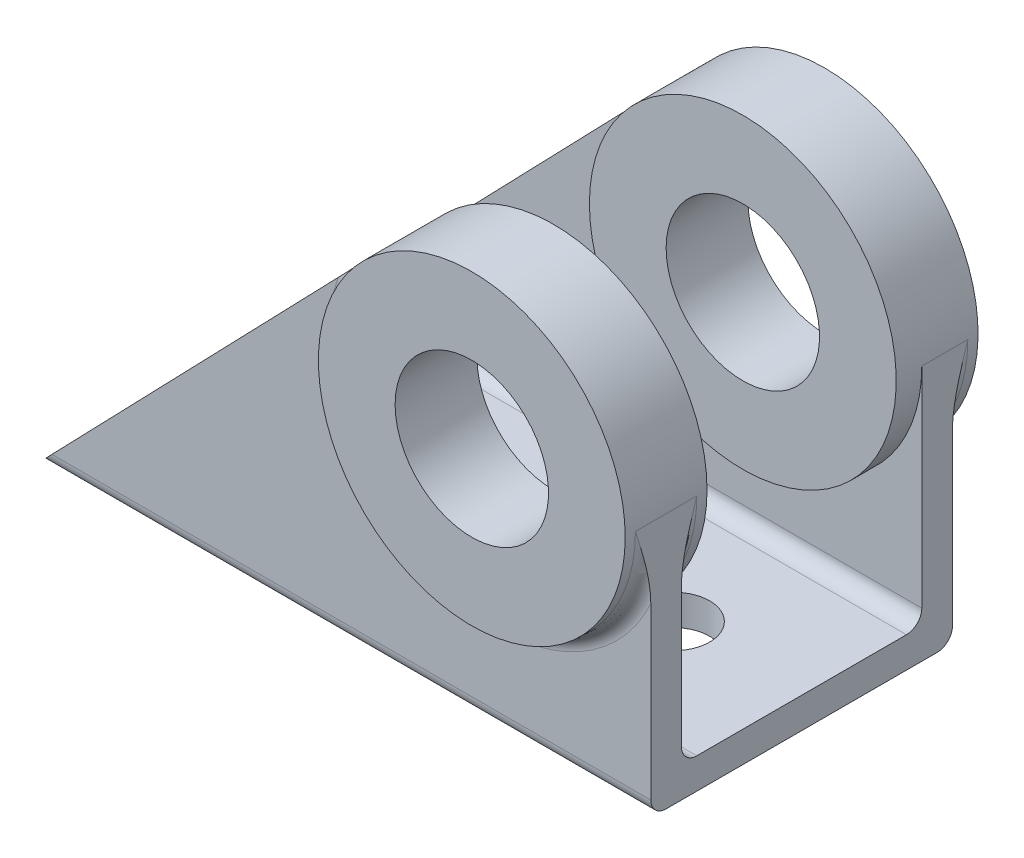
ISO-10303-21;
HEADER;
FILE_DESCRIPTION(('STEP AP214'),'2;1');
FILE_NAME('part.step','',(''),(''),'','','');
FILE_SCHEMA(('AUTOMOTIVE_DESIGN { 1 0 10303 214 1 1 1 1 }'));
ENDSEC;
DATA;
#1=APPLICATION_CONTEXT('core data for automotive mechanical design processes');
#2=APPLICATION_PROTOCOL_DEFINITION('international standard','automotive_design',2000,#1);
#3=PRODUCT_CONTEXT('',#1,'mechanical');
#4=PRODUCT('Part','Part','',(#3));
#5=PRODUCT_RELATED_PRODUCT_CATEGORY('part','',(#4));
#6=PRODUCT_DEFINITION_FORMATION('','',#4);
#7=PRODUCT_DEFINITION_CONTEXT('part definition',#1,'design');
#8=PRODUCT_DEFINITION('design','',#6,#7);
#9=PRODUCT_DEFINITION_SHAPE('','',#8);
#10=(LENGTH_UNIT() NAMED_UNIT(*) SI_UNIT(.MILLI.,.METRE.));
#11=(NAMED_UNIT(*) PLANE_ANGLE_UNIT() SI_UNIT($,.RADIAN.));
#12=(NAMED_UNIT(*) SI_UNIT($,.STERADIAN.) SOLID_ANGLE_UNIT());
#13=UNCERTAINTY_MEASURE_WITH_UNIT(LENGTH_MEASURE(1.E-05),#10,'distance_accuracy_value','');
#14=(GEOMETRIC_REPRESENTATION_CONTEXT(3) GLOBAL_UNCERTAINTY_ASSIGNED_CONTEXT((#13)) GLOBAL_UNIT_ASSIGNED_CONTEXT((#10,
#11,#12)) REPRESENTATION_CONTEXT('',''));
#15=CARTESIAN_POINT('',(0.,0.,0.));
#16=DIRECTION('',(0.,0.,1.));
#17=DIRECTION('',(1.,0.,0.));
#18=AXIS2_PLACEMENT_3D('',#15,#16,#17);
#19=CARTESIAN_POINT('',(5.79503497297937,5.99999999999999,-53.));
#20=DIRECTION('',(0.,1.,0.));
#21=DIRECTION('',(-1.,0.,0.));
#22=AXIS2_PLACEMENT_3D('',#19,#20,#21);
#23=PLANE('',#22);
#24=CARTESIAN_POINT('',(25.,5.99999999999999,-23.5));
#25=DIRECTION('',(0.,1.,0.));
#26=DIRECTION('',(-1.,0.,0.));
#27=AXIS2_PLACEMENT_3D('',#24,#25,#26);
#28=CIRCLE('',#27,7.);
#29=CARTESIAN_POINT('',(18.,5.99999999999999,-23.5));
#30=VERTEX_POINT('',#29);
#31=EDGE_CURVE('E435',#30,#30,#28,.T.);
#32=ORIENTED_EDGE('',*,*,#31,.F.);
#33=EDGE_LOOP('',(#32));
#34=FACE_BOUND('',#33,.T.);
#35=CARTESIAN_POINT('',(95.,5.99999999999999,-23.5));
#36=DIRECTION('',(0.,1.,0.));
#37=DIRECTION('',(-1.,0.,0.));
#38=AXIS2_PLACEMENT_3D('',#35,#36,#37);
#39=CIRCLE('',#38,7.);
#40=CARTESIAN_POINT('',(88.,5.99999999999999,-23.5));
#41=VERTEX_POINT('',#40);
#42=EDGE_CURVE('E427',#41,#41,#39,.T.);
#43=ORIENTED_EDGE('',*,*,#42,.F.);
#44=EDGE_LOOP('',(#43));
#45=FACE_BOUND('',#44,.T.);
#46=DIRECTION('',(0.,0.,1.));
#47=VECTOR('',#46,1.);
#48=CARTESIAN_POINT('',(5.79503497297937,5.99999999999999,-53.));
#49=LINE('',#48,#47);
#50=CARTESIAN_POINT('',(5.79503497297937,5.99999999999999,-44.));
#51=VERTEX_POINT('',#50);
#52=CARTESIAN_POINT('',(5.79503497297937,5.99999999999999,-3.));
#53=VERTEX_POINT('',#52);
#54=EDGE_CURVE('E244',#51,#53,#49,.T.);
#55=ORIENTED_EDGE('',*,*,#54,.T.);
#56=DIRECTION('',(-1.,0.,0.));
#57=VECTOR('',#56,1.);
#58=CARTESIAN_POINT('',(5.79503497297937,5.99999999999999,-3.));
#59=LINE('',#58,#57);
#60=CARTESIAN_POINT('',(120.,5.99999999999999,-3.));
#61=VERTEX_POINT('',#60);
#62=EDGE_CURVE('E325',#53,#61,#59,.F.);
#63=ORIENTED_EDGE('',*,*,#62,.T.);
#64=DIRECTION('',(0.,0.,1.));
#65=VECTOR('',#64,1.);
#66=CARTESIAN_POINT('',(120.,5.99999999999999,-53.));
#67=LINE('',#66,#65);
#68=CARTESIAN_POINT('',(120.,5.99999999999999,-44.));
#69=VERTEX_POINT('',#68);
#70=EDGE_CURVE('E243',#69,#61,#67,.T.);
#71=ORIENTED_EDGE('',*,*,#70,.F.);
#72=DIRECTION('',(-1.,0.,0.));
#73=VECTOR('',#72,1.);
#74=CARTESIAN_POINT('',(5.79503497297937,5.99999999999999,-44.));
#75=LINE('',#74,#73);
#76=EDGE_CURVE('E322',#69,#51,#75,.T.);
#77=ORIENTED_EDGE('',*,*,#76,.T.);
#78=EDGE_LOOP('',(#55,#63,#71,#77));
#79=FACE_BOUND('',#78,.T.);
#80=ADVANCED_FACE('F45',(#34,#45,#79),#23,.T.);
#81=CARTESIAN_POINT('',(68.4214276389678,70.841430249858,6.));
#82=DIRECTION('',(0.719285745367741,-0.694714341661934,0.));
#83=DIRECTION('',(0.694714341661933,0.719285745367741,0.));
#84=AXIS2_PLACEMENT_3D('',#81,#82,#83);
#85=PLANE('',#84);
#86=DIRECTION('',(0.,0.,-1.));
#87=VECTOR('',#86,1.);
#88=CARTESIAN_POINT('',(0.,0.,6.));
#89=LINE('',#88,#87);
#90=CARTESIAN_POINT('',(0.,0.,3.));
#91=VERTEX_POINT('',#90);
#92=CARTESIAN_POINT('',(0.,0.,-50.));
#93=VERTEX_POINT('',#92);
#94=EDGE_CURVE('E266',#91,#93,#89,.T.);
#95=ORIENTED_EDGE('',*,*,#94,.F.);
#96=CARTESIAN_POINT('',(2.8975174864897,3.,3.));
#97=DIRECTION('',(0.719285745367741,-0.694714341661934,0.));
#98=DIRECTION('',(-0.694714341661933,-0.719285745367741,0.));
#99=AXIS2_PLACEMENT_3D('',#96,#97,#98);
#100=ELLIPSE('',#99,4.17080418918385,3.);
#101=CARTESIAN_POINT('',(2.8975174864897,3.,6.));
#102=VERTEX_POINT('',#101);
#103=EDGE_CURVE('E320',#91,#102,#100,.F.);
#104=ORIENTED_EDGE('',*,*,#103,.T.);
#105=DIRECTION('',(-0.694714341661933,-0.719285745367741,0.));
#106=VECTOR('',#105,1.);
#107=CARTESIAN_POINT('',(68.4214276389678,70.841430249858,6.));
#108=LINE('',#107,#106);
#109=CARTESIAN_POINT('',(58.8706844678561,60.9528861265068,6.));
#110=VERTEX_POINT('',#109);
#111=EDGE_CURVE('E249',#110,#102,#108,.T.);
#112=ORIENTED_EDGE('',*,*,#111,.F.);
#113=CARTESIAN_POINT('',(58.8706844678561,60.9528861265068,6.));
#114=CARTESIAN_POINT('',(59.0469665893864,61.1354031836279,6.0000405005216));
#115=CARTESIAN_POINT('',(59.2232112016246,61.3178814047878,6.00558547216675));
#116=CARTESIAN_POINT('',(59.5753606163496,61.6824860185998,6.02646450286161));
#117=CARTESIAN_POINT('',(59.7512655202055,61.8646125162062,6.04179495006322));
#118=CARTESIAN_POINT('',(60.1023085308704,62.2280715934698,6.08099423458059));
#119=CARTESIAN_POINT('',(60.2774474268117,62.4094049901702,6.10484880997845));
#120=CARTESIAN_POINT('',(60.6271583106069,62.7714848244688,6.16012923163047));
#121=CARTESIAN_POINT('',(60.8017302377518,62.9522311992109,6.1915558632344));
#122=CARTESIAN_POINT('',(61.3223929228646,63.491309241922,6.29545901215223));
#123=CARTESIAN_POINT('',(61.6675388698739,63.8486626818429,6.37781613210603));
#124=CARTESIAN_POINT('',(62.3552134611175,64.5606596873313,6.56340767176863));
#125=CARTESIAN_POINT('',(62.6977407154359,64.9153018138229,6.66665247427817));
#126=CARTESIAN_POINT('',(63.491839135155,65.7374867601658,6.92593512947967));
#127=CARTESIAN_POINT('',(63.9424224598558,66.2040068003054,7.08819399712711));
#128=CARTESIAN_POINT('',(64.8398784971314,67.1332050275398,7.43285154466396));
#129=CARTESIAN_POINT('',(65.2867504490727,67.5958824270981,7.61525424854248));
#130=CARTESIAN_POINT('',(66.6246104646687,68.9810613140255,8.18214148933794));
#131=CARTESIAN_POINT('',(67.5116040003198,69.8994269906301,8.58585670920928));
#132=CARTESIAN_POINT('',(68.4061305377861,70.8255921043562,8.99303691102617));
#133=CARTESIAN_POINT('',(68.4137790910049,70.833511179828,8.99651846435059));
#134=CARTESIAN_POINT('',(68.4214276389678,70.841430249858,9.));
#135=B_SPLINE_CURVE_WITH_KNOTS('',3,(#113,#114,#115,#116,#117,#118,#119,#120,#121,#122,#123,
#124,#125,#126,#127,#128,#129,#130,#131,#132,#133,#134),.UNSPECIFIED.,.F.,.F.,(4,2,2,2,2,2,2,2,
2,2,4),(0.,0.761105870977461,1.52193097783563,2.28148904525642,3.04112592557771,
4.55127561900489,6.06217782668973,8.06739597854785,10.0730154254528,14.0897645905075,
14.1244056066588),.UNSPECIFIED.);
#136=CARTESIAN_POINT('',(68.4214276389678,70.841430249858,9.));
#137=VERTEX_POINT('',#136);
#138=EDGE_CURVE('E403',#110,#137,#135,.T.);
#139=ORIENTED_EDGE('',*,*,#138,.T.);
#140=DIRECTION('',(0.,0.,-1.));
#141=VECTOR('',#140,1.);
#142=CARTESIAN_POINT('',(68.4214276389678,70.841430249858,6.));
#143=LINE('',#142,#141);
#144=CARTESIAN_POINT('',(68.4214276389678,70.841430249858,-3.));
#145=VERTEX_POINT('',#144);
#146=EDGE_CURVE('E256',#137,#145,#143,.T.);
#147=ORIENTED_EDGE('',*,*,#146,.T.);
#148=CARTESIAN_POINT('',(58.8706844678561,60.9528861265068,0.));
#149=CARTESIAN_POINT('',(59.0469665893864,61.1354031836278,-4.05005216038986E-05));
#150=CARTESIAN_POINT('',(59.2232112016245,61.3178814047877,-0.00558547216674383));
#151=CARTESIAN_POINT('',(59.5753606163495,61.6824860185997,-0.026464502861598));
#152=CARTESIAN_POINT('',(59.7512655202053,61.864612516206,-0.0417949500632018));
#153=CARTESIAN_POINT('',(60.1023085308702,62.2280715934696,-0.0809942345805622));
#154=CARTESIAN_POINT('',(60.2774474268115,62.40940499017,-0.104848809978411));
#155=CARTESIAN_POINT('',(60.6271583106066,62.7714848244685,-0.160129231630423));
#156=CARTESIAN_POINT('',(60.8017302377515,62.9522311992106,-0.191555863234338));
#157=CARTESIAN_POINT('',(61.3223929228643,63.4913092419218,-0.295459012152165));
#158=CARTESIAN_POINT('',(61.6675388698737,63.8486626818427,-0.377816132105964));
#159=CARTESIAN_POINT('',(62.3552134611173,64.5606596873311,-0.563407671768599));
#160=CARTESIAN_POINT('',(62.6977407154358,64.9153018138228,-0.666652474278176));
#161=CARTESIAN_POINT('',(63.491839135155,65.7374867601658,-0.925935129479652));
#162=CARTESIAN_POINT('',(63.9424224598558,66.2040068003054,-1.088193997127));
#163=CARTESIAN_POINT('',(64.8398784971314,67.1332050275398,-1.43285154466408));
#164=CARTESIAN_POINT('',(65.2867504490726,67.5958824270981,-1.6152542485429));
#165=CARTESIAN_POINT('',(66.624610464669,68.9810613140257,-2.18214148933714));
#166=CARTESIAN_POINT('',(67.5116040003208,69.8994269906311,-2.58585670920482));
#167=CARTESIAN_POINT('',(68.4061305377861,70.8255921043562,-2.99303691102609));
#168=CARTESIAN_POINT('',(68.4137790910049,70.833511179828,-2.99651846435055));
#169=CARTESIAN_POINT('',(68.4214276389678,70.841430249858,-3.));
#170=B_SPLINE_CURVE_WITH_KNOTS('',3,(#148,#149,#150,#151,#152,#153,#154,#155,#156,#157,#158,
#159,#160,#161,#162,#163,#164,#165,#166,#167,#168,#169),.UNSPECIFIED.,.F.,.F.,(4,2,2,2,2,2,2,2,
2,2,4),(0.,0.761105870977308,1.52193097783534,2.28148904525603,3.0411259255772,4.55127561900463,
6.06217782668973,8.06739597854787,10.0730154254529,14.0897645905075,14.1244056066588),.UNSPECIFIED.);
#171=CARTESIAN_POINT('',(58.8706844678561,60.9528861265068,0.));
#172=VERTEX_POINT('',#171);
#173=EDGE_CURVE('E391',#145,#172,#170,.F.);
#174=ORIENTED_EDGE('',*,*,#173,.T.);
#175=DIRECTION('',(-0.694714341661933,-0.719285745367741,0.));
#176=VECTOR('',#175,1.);
#177=CARTESIAN_POINT('',(68.4214276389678,70.841430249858,0.));
#178=LINE('',#177,#176);
#179=CARTESIAN_POINT('',(8.69255245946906,8.99999999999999,0.));
#180=VERTEX_POINT('',#179);
#181=EDGE_CURVE('E246',#172,#180,#178,.T.);
#182=ORIENTED_EDGE('',*,*,#181,.T.);
#183=CARTESIAN_POINT('',(8.69255245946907,8.99999999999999,-3.));
#184=DIRECTION('',(0.719285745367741,-0.694714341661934,0.));
#185=DIRECTION('',(-0.694714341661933,-0.719285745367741,0.));
#186=AXIS2_PLACEMENT_3D('',#183,#184,#185);
#187=ELLIPSE('',#186,4.17080418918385,3.);
#188=EDGE_CURVE('E67',#180,#53,#187,.T.);
#189=ORIENTED_EDGE('',*,*,#188,.T.);
#190=ORIENTED_EDGE('',*,*,#54,.F.);
#191=CARTESIAN_POINT('',(8.69255245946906,8.99999999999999,-44.));
#192=DIRECTION('',(0.719285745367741,-0.694714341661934,0.));
#193=DIRECTION('',(-0.694714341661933,-0.719285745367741,0.));
#194=AXIS2_PLACEMENT_3D('',#191,#192,#193);
#195=ELLIPSE('',#194,4.17080418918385,3.);
#196=CARTESIAN_POINT('',(8.69255245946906,8.99999999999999,-47.));
#197=VERTEX_POINT('',#196);
#198=EDGE_CURVE('E54',#51,#197,#195,.T.);
#199=ORIENTED_EDGE('',*,*,#198,.T.);
#200=DIRECTION('',(0.694714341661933,0.719285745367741,0.));
#201=VECTOR('',#200,1.);
#202=CARTESIAN_POINT('',(5.79503497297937,5.99999999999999,-47.));
#203=LINE('',#202,#201);
#204=CARTESIAN_POINT('',(68.4214276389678,70.841430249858,-47.));
#205=VERTEX_POINT('',#204);
#206=EDGE_CURVE('E231',#197,#205,#203,.T.);
#207=ORIENTED_EDGE('',*,*,#206,.T.);
#208=DIRECTION('',(0.,0.,-1.));
#209=VECTOR('',#208,1.);
#210=CARTESIAN_POINT('',(68.4214276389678,70.841430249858,-47.));
#211=LINE('',#210,#209);
#212=CARTESIAN_POINT('',(68.4214276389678,70.841430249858,-56.));
#213=VERTEX_POINT('',#212);
#214=EDGE_CURVE('E234',#205,#213,#211,.T.);
#215=ORIENTED_EDGE('',*,*,#214,.T.);
#216=CARTESIAN_POINT('',(58.8706844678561,60.9528861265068,-53.));
#217=CARTESIAN_POINT('',(59.0469665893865,61.135403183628,-53.0000405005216));
#218=CARTESIAN_POINT('',(59.2232112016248,61.317881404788,-53.0055854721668));
#219=CARTESIAN_POINT('',(59.57536061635,61.6824860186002,-53.0264645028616));
#220=CARTESIAN_POINT('',(59.751265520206,61.8646125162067,-53.0417949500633));
#221=CARTESIAN_POINT('',(60.102308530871,62.2280715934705,-53.0809942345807));
#222=CARTESIAN_POINT('',(60.2774474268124,62.4094049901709,-53.1048488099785));
#223=CARTESIAN_POINT('',(60.6271583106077,62.7714848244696,-53.1601292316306));
#224=CARTESIAN_POINT('',(60.8017302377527,62.9522311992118,-53.1915558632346));
#225=CARTESIAN_POINT('',(61.3223929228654,63.4913092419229,-53.2954590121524));
#226=CARTESIAN_POINT('',(61.6675388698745,63.8486626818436,-53.3778161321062));
#227=CARTESIAN_POINT('',(62.3552134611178,64.5606596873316,-53.5634076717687));
#228=CARTESIAN_POINT('',(62.6977407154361,64.915301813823,-53.6666524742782));
#229=CARTESIAN_POINT('',(63.491839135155,65.7374867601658,-53.9259351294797));
#230=CARTESIAN_POINT('',(63.9424224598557,66.2040068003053,-54.0881939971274));
#231=CARTESIAN_POINT('',(64.8398784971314,67.1332050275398,-54.4328515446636));
#232=CARTESIAN_POINT('',(65.2867504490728,67.5958824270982,-54.6152542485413));
#233=CARTESIAN_POINT('',(66.6246104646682,68.9810613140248,-55.1821414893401));
#234=CARTESIAN_POINT('',(67.5116040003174,69.8994269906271,-55.5858567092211));
#235=CARTESIAN_POINT('',(68.4061305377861,70.8255921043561,-55.9930369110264));
#236=CARTESIAN_POINT('',(68.4137790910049,70.833511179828,-55.9965184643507));
#237=CARTESIAN_POINT('',(68.4214276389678,70.841430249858,-56.));
#238=B_SPLINE_CURVE_WITH_KNOTS('',3,(#216,#217,#218,#219,#220,#221,#222,#223,#224,#225,#226,
#227,#228,#229,#230,#231,#232,#233,#234,#235,#236,#237),.UNSPECIFIED.,.F.,.F.,(4,2,2,2,2,2,2,2,
2,2,4),(0.,0.761105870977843,1.52193097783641,2.2814890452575,3.0411259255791,4.55127561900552,
6.06217782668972,8.06739597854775,10.0730154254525,14.0897645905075,14.1244056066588),.UNSPECIFIED.);
#239=CARTESIAN_POINT('',(58.8706844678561,60.9528861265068,-53.));
#240=VERTEX_POINT('',#239);
#241=EDGE_CURVE('E340',#213,#240,#238,.F.);
#242=ORIENTED_EDGE('',*,*,#241,.T.);
#243=DIRECTION('',(-0.694714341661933,-0.719285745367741,0.));
#244=VECTOR('',#243,1.);
#245=CARTESIAN_POINT('',(0.,0.,-53.));
#246=LINE('',#245,#244);
#247=CARTESIAN_POINT('',(2.89751748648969,3.,-53.));
#248=VERTEX_POINT('',#247);
#249=EDGE_CURVE('E236',#240,#248,#246,.T.);
#250=ORIENTED_EDGE('',*,*,#249,.T.);
#251=CARTESIAN_POINT('',(2.89751748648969,3.,-50.));
#252=DIRECTION('',(0.719285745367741,-0.694714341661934,0.));
#253=DIRECTION('',(-0.694714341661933,-0.719285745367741,0.));
#254=AXIS2_PLACEMENT_3D('',#251,#252,#253);
#255=ELLIPSE('',#254,4.17080418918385,3.);
#256=EDGE_CURVE('E318',#248,#93,#255,.F.);
#257=ORIENTED_EDGE('',*,*,#256,.T.);
#258=EDGE_LOOP('',(#95,#104,#112,#139,#147,#174,#182,#189,#190,#199,#207,#215,#242,#250,#257));
#259=FACE_BOUND('',#258,.T.);
#260=ADVANCED_FACE('F359',(#259),#85,.F.);
#261=CARTESIAN_POINT('',(0.,0.,6.));
#262=DIRECTION('',(0.,1.,0.));
#263=DIRECTION('',(0.,0.,1.));
#264=AXIS2_PLACEMENT_3D('',#261,#262,#263);
#265=PLANE('',#264);
#266=CARTESIAN_POINT('',(25.,0.,-23.5));
#267=DIRECTION('',(0.,1.,0.));
#268=DIRECTION('',(0.,0.,1.));
#269=AXIS2_PLACEMENT_3D('',#266,#267,#268);
#270=CIRCLE('',#269,7.);
#271=CARTESIAN_POINT('',(25.,0.,-16.5));
#272=VERTEX_POINT('',#271);
#273=EDGE_CURVE('E49',#272,#272,#270,.T.);
#274=ORIENTED_EDGE('',*,*,#273,.T.);
#275=EDGE_LOOP('',(#274));
#276=FACE_BOUND('',#275,.T.);
#277=CARTESIAN_POINT('',(95.,0.,-23.5));
#278=DIRECTION('',(0.,1.,0.));
#279=DIRECTION('',(0.,0.,1.));
#280=AXIS2_PLACEMENT_3D('',#277,#278,#279);
#281=CIRCLE('',#280,7.);
#282=CARTESIAN_POINT('',(95.,0.,-16.5));
#283=VERTEX_POINT('',#282);
#284=EDGE_CURVE('E417',#283,#283,#281,.T.);
#285=ORIENTED_EDGE('',*,*,#284,.T.);
#286=EDGE_LOOP('',(#285));
#287=FACE_BOUND('',#286,.T.);
#288=DIRECTION('',(0.,0.,-1.));
#289=VECTOR('',#288,1.);
#290=CARTESIAN_POINT('',(120.,0.,6.));
#291=LINE('',#290,#289);
#292=CARTESIAN_POINT('',(120.,0.,3.));
#293=VERTEX_POINT('',#292);
#294=CARTESIAN_POINT('',(120.,0.,-50.));
#295=VERTEX_POINT('',#294);
#296=EDGE_CURVE('E263',#293,#295,#291,.T.);
#297=ORIENTED_EDGE('',*,*,#296,.F.);
#298=DIRECTION('',(1.,0.,0.));
#299=VECTOR('',#298,1.);
#300=CARTESIAN_POINT('',(0.,0.,3.));
#301=LINE('',#300,#299);
#302=EDGE_CURVE('E316',#293,#91,#301,.F.);
#303=ORIENTED_EDGE('',*,*,#302,.T.);
#304=ORIENTED_EDGE('',*,*,#94,.T.);
#305=DIRECTION('',(1.,0.,0.));
#306=VECTOR('',#305,1.);
#307=CARTESIAN_POINT('',(120.,0.,-50.));
#308=LINE('',#307,#306);
#309=EDGE_CURVE('E313',#93,#295,#308,.T.);
#310=ORIENTED_EDGE('',*,*,#309,.T.);
#311=EDGE_LOOP('',(#297,#303,#304,#310));
#312=FACE_BOUND('',#311,.T.);
#313=ADVANCED_FACE('F481',(#276,#287,#312),#265,.F.);
#314=CARTESIAN_POINT('',(120.,0.,6.));
#315=DIRECTION('',(-1.,0.,0.));
#316=DIRECTION('',(0.,0.,1.));
#317=AXIS2_PLACEMENT_3D('',#314,#315,#316);
#318=PLANE('',#317);
#319=DIRECTION('',(0.,1.,0.));
#320=VECTOR('',#319,1.);
#321=CARTESIAN_POINT('',(120.,0.,6.));
#322=LINE('',#321,#320);
#323=CARTESIAN_POINT('',(120.,3.,6.));
#324=VERTEX_POINT('',#323);
#325=CARTESIAN_POINT('',(120.,36.2522729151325,6.));
#326=VERTEX_POINT('',#325);
#327=EDGE_CURVE('E252',#324,#326,#322,.T.);
#328=ORIENTED_EDGE('',*,*,#327,.F.);
#329=CARTESIAN_POINT('',(120.,3.,3.));
#330=DIRECTION('',(-1.,0.,0.));
#331=DIRECTION('',(0.,0.,1.));
#332=AXIS2_PLACEMENT_3D('',#329,#330,#331);
#333=CIRCLE('',#332,3.);
#334=EDGE_CURVE('E311',#324,#293,#333,.F.);
#335=ORIENTED_EDGE('',*,*,#334,.T.);
#336=ORIENTED_EDGE('',*,*,#296,.T.);
#337=CARTESIAN_POINT('',(120.,3.,-50.));
#338=DIRECTION('',(-1.,0.,0.));
#339=DIRECTION('',(0.,0.,1.));
#340=AXIS2_PLACEMENT_3D('',#337,#338,#339);
#341=CIRCLE('',#340,3.);
#342=CARTESIAN_POINT('',(120.,3.,-53.));
#343=VERTEX_POINT('',#342);
#344=EDGE_CURVE('E309',#295,#343,#341,.F.);
#345=ORIENTED_EDGE('',*,*,#344,.T.);
#346=DIRECTION('',(0.,1.,0.));
#347=VECTOR('',#346,1.);
#348=CARTESIAN_POINT('',(120.,5.99999999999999,-53.));
#349=LINE('',#348,#347);
#350=CARTESIAN_POINT('',(120.,36.2522729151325,-53.));
#351=VERTEX_POINT('',#350);
#352=EDGE_CURVE('E240',#343,#351,#349,.T.);
#353=ORIENTED_EDGE('',*,*,#352,.T.);
#354=CARTESIAN_POINT('',(120.,36.2522729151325,-53.));
#355=CARTESIAN_POINT('',(120.,36.506020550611,-53.0000405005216));
#356=CARTESIAN_POINT('',(120.,36.7597141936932,-53.0055854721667));
#357=CARTESIAN_POINT('',(120.,37.2666123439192,-53.0264645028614));
#358=CARTESIAN_POINT('',(120.,37.5198169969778,-53.041794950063));
#359=CARTESIAN_POINT('',(120.,38.0251225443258,-53.0809942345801));
#360=CARTESIAN_POINT('',(120.,38.2772245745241,-53.1048488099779));
#361=CARTESIAN_POINT('',(120.,38.7806126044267,-53.1601292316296));
#362=CARTESIAN_POINT('',(120.,39.0318985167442,-53.1915558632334));
#363=CARTESIAN_POINT('',(120.,39.781361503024,-53.2954590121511));
#364=CARTESIAN_POINT('',(120.,40.2781785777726,-53.377816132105));
#365=CARTESIAN_POINT('',(120.,41.268045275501,-53.5634076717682));
#366=CARTESIAN_POINT('',(120.,41.7610928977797,-53.6666524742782));
#367=CARTESIAN_POINT('',(120.,42.9041503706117,-53.9259351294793));
#368=CARTESIAN_POINT('',(120.,43.5527382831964,-54.0881939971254));
#369=CARTESIAN_POINT('',(120.,44.8445729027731,-54.432851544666));
#370=CARTESIAN_POINT('',(120.,45.4878185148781,-54.6152542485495));
#371=CARTESIAN_POINT('',(120.,47.4135884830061,-55.1821414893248));
#372=CARTESIAN_POINT('',(120.,48.6903629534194,-55.5858567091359));
#373=CARTESIAN_POINT('',(120.,49.9779807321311,-55.9930369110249));
#374=CARTESIAN_POINT('',(120.,49.9889903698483,-55.9965184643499));
#375=CARTESIAN_POINT('',(120.,50.,-56.));
#376=B_SPLINE_CURVE_WITH_KNOTS('',3,(#354,#355,#356,#357,#358,#359,#360,#361,#362,#363,#364,
#365,#366,#367,#368,#369,#370,#371,#372,#373,#374,#375),.UNSPECIFIED.,.F.,.F.,(4,2,2,2,2,2,2,2,
2,2,4),(0.,0.761105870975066,1.52193097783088,2.28148904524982,3.04112592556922,4.5512756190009,
6.06217782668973,8.06739597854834,10.0730154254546,14.0897645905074,14.1244056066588),.UNSPECIFIED.);
#377=CARTESIAN_POINT('',(120.,50.,-56.));
#378=VERTEX_POINT('',#377);
#379=EDGE_CURVE('E331',#351,#378,#376,.T.);
#380=ORIENTED_EDGE('',*,*,#379,.T.);
#381=DIRECTION('',(0.,0.,-1.));
#382=VECTOR('',#381,1.);
#383=CARTESIAN_POINT('',(120.,50.,-47.));
#384=LINE('',#383,#382);
#385=CARTESIAN_POINT('',(120.,50.,-47.));
#386=VERTEX_POINT('',#385);
#387=EDGE_CURVE('E233',#386,#378,#384,.T.);
#388=ORIENTED_EDGE('',*,*,#387,.F.);
#389=DIRECTION('',(0.,-1.,0.));
#390=VECTOR('',#389,1.);
#391=CARTESIAN_POINT('',(120.,50.,-47.));
#392=LINE('',#391,#390);
#393=CARTESIAN_POINT('',(120.,8.99999999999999,-47.));
#394=VERTEX_POINT('',#393);
#395=EDGE_CURVE('E228',#386,#394,#392,.T.);
#396=ORIENTED_EDGE('',*,*,#395,.T.);
#397=CARTESIAN_POINT('',(120.,8.99999999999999,-44.));
#398=DIRECTION('',(-1.,0.,0.));
#399=DIRECTION('',(0.,0.,1.));
#400=AXIS2_PLACEMENT_3D('',#397,#398,#399);
#401=CIRCLE('',#400,3.);
#402=EDGE_CURVE('E11',#394,#69,#401,.T.);
#403=ORIENTED_EDGE('',*,*,#402,.T.);
#404=ORIENTED_EDGE('',*,*,#70,.T.);
#405=CARTESIAN_POINT('',(120.,8.99999999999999,-3.));
#406=DIRECTION('',(-1.,0.,0.));
#407=DIRECTION('',(0.,0.,1.));
#408=AXIS2_PLACEMENT_3D('',#405,#406,#407);
#409=CIRCLE('',#408,3.);
#410=CARTESIAN_POINT('',(120.,8.99999999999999,0.));
#411=VERTEX_POINT('',#410);
#412=EDGE_CURVE('E411',#61,#411,#409,.T.);
#413=ORIENTED_EDGE('',*,*,#412,.T.);
#414=DIRECTION('',(0.,1.,0.));
#415=VECTOR('',#414,1.);
#416=CARTESIAN_POINT('',(120.,0.,0.));
#417=LINE('',#416,#415);
#418=CARTESIAN_POINT('',(120.,36.2522729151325,0.));
#419=VERTEX_POINT('',#418);
#420=EDGE_CURVE('E253',#411,#419,#417,.T.);
#421=ORIENTED_EDGE('',*,*,#420,.T.);
#422=CARTESIAN_POINT('',(120.,36.2522729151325,0.));
#423=CARTESIAN_POINT('',(120.,36.506020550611,-4.05005216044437E-05));
#424=CARTESIAN_POINT('',(120.,36.7597141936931,-0.00558547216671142));
#425=CARTESIAN_POINT('',(120.,37.2666123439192,-0.0264645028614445));
#426=CARTESIAN_POINT('',(120.,37.5198169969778,-0.0417949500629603));
#427=CARTESIAN_POINT('',(120.,38.0251225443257,-0.0809942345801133));
#428=CARTESIAN_POINT('',(120.,38.277224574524,-0.104848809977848));
#429=CARTESIAN_POINT('',(120.,38.7806126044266,-0.160129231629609));
#430=CARTESIAN_POINT('',(120.,39.0318985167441,-0.191555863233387));
#431=CARTESIAN_POINT('',(120.,39.7813615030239,-0.295459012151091));
#432=CARTESIAN_POINT('',(120.,40.2781785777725,-0.377816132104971));
#433=CARTESIAN_POINT('',(120.,41.268045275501,-0.563407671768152));
#434=CARTESIAN_POINT('',(120.,41.7610928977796,-0.666652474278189));
#435=CARTESIAN_POINT('',(120.,42.9041503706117,-0.925935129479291));
#436=CARTESIAN_POINT('',(120.,43.5527382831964,-1.08819399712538));
#437=CARTESIAN_POINT('',(120.,44.8445729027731,-1.43285154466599));
#438=CARTESIAN_POINT('',(120.,45.4878185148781,-1.61525424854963));
#439=CARTESIAN_POINT('',(120.,47.4135884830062,-2.1821414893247));
#440=CARTESIAN_POINT('',(120.,48.6903629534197,-2.58585670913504));
#441=CARTESIAN_POINT('',(120.,49.9779807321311,-2.99303691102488));
#442=CARTESIAN_POINT('',(120.,49.9889903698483,-2.99651846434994));
#443=CARTESIAN_POINT('',(120.,50.,-3.));
#444=B_SPLINE_CURVE_WITH_KNOTS('',3,(#422,#423,#424,#425,#426,#427,#428,#429,#430,#431,#432,
#433,#434,#435,#436,#437,#438,#439,#440,#441,#442,#443),.UNSPECIFIED.,.F.,.F.,(4,2,2,2,2,2,2,2,
2,2,4),(0.,0.761105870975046,1.52193097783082,2.28148904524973,3.04112592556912,
4.55127561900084,6.06217782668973,8.06739597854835,10.0730154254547,14.0897645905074,
14.1244056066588),.UNSPECIFIED.);
#445=CARTESIAN_POINT('',(120.,50.,-3.));
#446=VERTEX_POINT('',#445);
#447=EDGE_CURVE('E385',#419,#446,#444,.T.);
#448=ORIENTED_EDGE('',*,*,#447,.T.);
#449=DIRECTION('',(0.,0.,-1.));
#450=VECTOR('',#449,1.);
#451=CARTESIAN_POINT('',(120.,50.,6.));
#452=LINE('',#451,#450);
#453=CARTESIAN_POINT('',(120.,50.,9.));
#454=VERTEX_POINT('',#453);
#455=EDGE_CURVE('E261',#454,#446,#452,.T.);
#456=ORIENTED_EDGE('',*,*,#455,.F.);
#457=CARTESIAN_POINT('',(120.,36.2522729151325,6.));
#458=CARTESIAN_POINT('',(120.,36.506020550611,6.0000405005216));
#459=CARTESIAN_POINT('',(120.,36.7597141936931,6.00558547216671));
#460=CARTESIAN_POINT('',(120.,37.2666123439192,6.02646450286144));
#461=CARTESIAN_POINT('',(120.,37.5198169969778,6.04179495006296));
#462=CARTESIAN_POINT('',(120.,38.0251225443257,6.08099423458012));
#463=CARTESIAN_POINT('',(120.,38.2772245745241,6.10484880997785));
#464=CARTESIAN_POINT('',(120.,38.7806126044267,6.16012923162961));
#465=CARTESIAN_POINT('',(120.,39.0318985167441,6.19155586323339));
#466=CARTESIAN_POINT('',(120.,39.7813615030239,6.2954590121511));
#467=CARTESIAN_POINT('',(120.,40.2781785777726,6.37781613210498));
#468=CARTESIAN_POINT('',(120.,41.268045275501,6.56340767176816));
#469=CARTESIAN_POINT('',(120.,41.7610928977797,6.66665247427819));
#470=CARTESIAN_POINT('',(120.,42.9041503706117,6.92593512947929));
#471=CARTESIAN_POINT('',(120.,43.5527382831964,7.08819399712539));
#472=CARTESIAN_POINT('',(120.,44.8445729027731,7.43285154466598));
#473=CARTESIAN_POINT('',(120.,45.4878185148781,7.6152542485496));
#474=CARTESIAN_POINT('',(120.,47.4135884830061,8.18214148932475));
#475=CARTESIAN_POINT('',(120.,48.6903629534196,8.58585670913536));
#476=CARTESIAN_POINT('',(120.,49.9779807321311,8.99303691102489));
#477=CARTESIAN_POINT('',(120.,49.9889903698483,8.99651846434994));
#478=CARTESIAN_POINT('',(120.,50.,9.));
#479=B_SPLINE_CURVE_WITH_KNOTS('',3,(#457,#458,#459,#460,#461,#462,#463,#464,#465,#466,#467,
#468,#469,#470,#471,#472,#473,#474,#475,#476,#477,#478),.UNSPECIFIED.,.F.,.F.,(4,2,2,2,2,2,2,2,
2,2,4),(0.,0.761105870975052,1.52193097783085,2.28148904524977,3.04112592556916,
4.55127561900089,6.06217782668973,8.06739597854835,10.0730154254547,14.0897645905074,
14.1244056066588),.UNSPECIFIED.);
#480=EDGE_CURVE('E397',#454,#326,#479,.F.);
#481=ORIENTED_EDGE('',*,*,#480,.T.);
#482=EDGE_LOOP('',(#328,#335,#336,#345,#353,#380,#388,#396,#403,#404,#413,#421,#448,#456,#481));
#483=FACE_BOUND('',#482,.T.);
#484=ADVANCED_FACE('F348',(#483),#318,.F.);
#485=CARTESIAN_POINT('',(90.,50.,6.));
#486=DIRECTION('',(0.,0.,-1.));
#487=DIRECTION('',(-1.,0.,0.));
#488=AXIS2_PLACEMENT_3D('',#485,#486,#487);
#489=CYLINDRICAL_SURFACE('',#488,30.);
#490=ORIENTED_EDGE('',*,*,#455,.T.);
#491=CARTESIAN_POINT('',(90.,50.,-3.));
#492=DIRECTION('',(0.,0.,1.));
#493=DIRECTION('',(1.,0.,0.));
#494=AXIS2_PLACEMENT_3D('',#491,#492,#493);
#495=CIRCLE('',#494,30.);
#496=EDGE_CURVE('E301',#446,#145,#495,.F.);
#497=ORIENTED_EDGE('',*,*,#496,.T.);
#498=ORIENTED_EDGE('',*,*,#146,.F.);
#499=CARTESIAN_POINT('',(90.,50.,9.));
#500=DIRECTION('',(0.,0.,1.));
#501=DIRECTION('',(1.,0.,0.));
#502=AXIS2_PLACEMENT_3D('',#499,#500,#501);
#503=CIRCLE('',#502,30.);
#504=EDGE_CURVE('E298',#137,#454,#503,.T.);
#505=ORIENTED_EDGE('',*,*,#504,.T.);
#506=EDGE_LOOP('',(#490,#497,#498,#505));
#507=FACE_BOUND('',#506,.T.);
#508=CARTESIAN_POINT('',(90.,50.,-5.));
#509=DIRECTION('',(0.,0.,1.));
#510=DIRECTION('',(1.,0.,0.));
#511=AXIS2_PLACEMENT_3D('',#508,#509,#510);
#512=CIRCLE('',#511,30.);
#513=CARTESIAN_POINT('',(120.,50.,-5.));
#514=VERTEX_POINT('',#513);
#515=EDGE_CURVE('E225',#514,#514,#512,.T.);
#516=ORIENTED_EDGE('',*,*,#515,.T.);
#517=EDGE_LOOP('',(#516));
#518=FACE_BOUND('',#517,.T.);
#519=CARTESIAN_POINT('',(90.,50.,11.));
#520=DIRECTION('',(0.,0.,1.));
#521=DIRECTION('',(1.,0.,0.));
#522=AXIS2_PLACEMENT_3D('',#519,#520,#521);
#523=CIRCLE('',#522,30.);
#524=CARTESIAN_POINT('',(120.,50.,11.));
#525=VERTEX_POINT('',#524);
#526=EDGE_CURVE('E218',#525,#525,#523,.T.);
#527=ORIENTED_EDGE('',*,*,#526,.F.);
#528=EDGE_LOOP('',(#527));
#529=FACE_BOUND('',#528,.T.);
#530=ADVANCED_FACE('F498',(#507,#518,#529),#489,.T.);
#531=CARTESIAN_POINT('',(90.,50.,6.));
#532=DIRECTION('',(0.,0.,1.));
#533=DIRECTION('',(1.,0.,0.));
#534=AXIS2_PLACEMENT_3D('',#531,#532,#533);
#535=PLANE('',#534);
#536=ORIENTED_EDGE('',*,*,#327,.T.);
#537=CARTESIAN_POINT('',(90.,50.,6.));
#538=DIRECTION('',(0.,0.,1.));
#539=DIRECTION('',(1.,0.,0.));
#540=AXIS2_PLACEMENT_3D('',#537,#538,#539);
#541=CIRCLE('',#540,33.);
#542=EDGE_CURVE('E307',#326,#110,#541,.F.);
#543=ORIENTED_EDGE('',*,*,#542,.T.);
#544=ORIENTED_EDGE('',*,*,#111,.T.);
#545=DIRECTION('',(1.,0.,0.));
#546=VECTOR('',#545,1.);
#547=CARTESIAN_POINT('',(120.,3.,6.));
#548=LINE('',#547,#546);
#549=EDGE_CURVE('E304',#102,#324,#548,.T.);
#550=ORIENTED_EDGE('',*,*,#549,.T.);
#551=EDGE_LOOP('',(#536,#543,#544,#550));
#552=FACE_BOUND('',#551,.T.);
#553=ADVANCED_FACE('F490',(#552),#535,.T.);
#554=CARTESIAN_POINT('',(90.,50.,0.));
#555=DIRECTION('',(0.,0.,1.));
#556=DIRECTION('',(1.,0.,0.));
#557=AXIS2_PLACEMENT_3D('',#554,#555,#556);
#558=PLANE('',#557);
#559=ORIENTED_EDGE('',*,*,#181,.F.);
#560=CARTESIAN_POINT('',(90.,50.,0.));
#561=DIRECTION('',(0.,0.,1.));
#562=DIRECTION('',(1.,0.,0.));
#563=AXIS2_PLACEMENT_3D('',#560,#561,#562);
#564=CIRCLE('',#563,33.);
#565=EDGE_CURVE('E295',#172,#419,#564,.T.);
#566=ORIENTED_EDGE('',*,*,#565,.T.);
#567=ORIENTED_EDGE('',*,*,#420,.F.);
#568=DIRECTION('',(-1.,0.,0.));
#569=VECTOR('',#568,1.);
#570=CARTESIAN_POINT('',(90.,8.99999999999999,0.));
#571=LINE('',#570,#569);
#572=EDGE_CURVE('E292',#411,#180,#571,.T.);
#573=ORIENTED_EDGE('',*,*,#572,.T.);
#574=EDGE_LOOP('',(#559,#566,#567,#573));
#575=FACE_BOUND('',#574,.T.);
#576=ADVANCED_FACE('F506',(#575),#558,.F.);
#577=CARTESIAN_POINT('',(5.79503497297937,5.99999999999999,-53.));
#578=DIRECTION('',(0.,0.,-1.));
#579=DIRECTION('',(-1.,0.,0.));
#580=AXIS2_PLACEMENT_3D('',#577,#578,#579);
#581=PLANE('',#580);
#582=ORIENTED_EDGE('',*,*,#352,.F.);
#583=DIRECTION('',(1.,0.,0.));
#584=VECTOR('',#583,1.);
#585=CARTESIAN_POINT('',(0.,3.,-53.));
#586=LINE('',#585,#584);
#587=EDGE_CURVE('E286',#343,#248,#586,.F.);
#588=ORIENTED_EDGE('',*,*,#587,.T.);
#589=ORIENTED_EDGE('',*,*,#249,.F.);
#590=CARTESIAN_POINT('',(90.,50.,-53.));
#591=DIRECTION('',(0.,0.,-1.));
#592=DIRECTION('',(-1.,0.,0.));
#593=AXIS2_PLACEMENT_3D('',#590,#591,#592);
#594=CIRCLE('',#593,33.);
#595=CARTESIAN_POINT('',(57.4286461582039,55.3015949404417,-53.));
#596=VERTEX_POINT('',#595);
#597=EDGE_CURVE('E282',#240,#596,#594,.F.);
#598=ORIENTED_EDGE('',*,*,#597,.T.);
#599=CARTESIAN_POINT('',(30.7793566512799,59.6392635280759,-53.));
#600=DIRECTION('',(0.,0.,-1.));
#601=DIRECTION('',(-1.,0.,0.));
#602=AXIS2_PLACEMENT_3D('',#599,#600,#601);
#603=CIRCLE('',#602,27.);
#604=CARTESIAN_POINT('',(49.9789535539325,40.6557054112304,-53.));
#605=VERTEX_POINT('',#604);
#606=EDGE_CURVE('E280',#596,#605,#603,.T.);
#607=ORIENTED_EDGE('',*,*,#606,.T.);
#608=CARTESIAN_POINT('',(62.7786848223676,28.,-53.));
#609=DIRECTION('',(0.,0.,-1.));
#610=DIRECTION('',(-1.,0.,0.));
#611=AXIS2_PLACEMENT_3D('',#608,#609,#610);
#612=CIRCLE('',#611,18.);
#613=CARTESIAN_POINT('',(72.4674086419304,12.8300088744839,-53.));
#614=VERTEX_POINT('',#613);
#615=EDGE_CURVE('E278',#605,#614,#612,.F.);
#616=ORIENTED_EDGE('',*,*,#615,.T.);
#617=CARTESIAN_POINT('',(87.0004943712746,-9.92497781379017,-53.));
#618=DIRECTION('',(0.,0.,-1.));
#619=DIRECTION('',(-1.,0.,0.));
#620=AXIS2_PLACEMENT_3D('',#617,#618,#619);
#621=CIRCLE('',#620,27.);
#622=CARTESIAN_POINT('',(88.350271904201,17.0412622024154,-53.));
#623=VERTEX_POINT('',#622);
#624=EDGE_CURVE('E276',#614,#623,#621,.T.);
#625=ORIENTED_EDGE('',*,*,#624,.T.);
#626=CARTESIAN_POINT('',(90.,50.,-53.));
#627=DIRECTION('',(0.,0.,-1.));
#628=DIRECTION('',(-1.,0.,0.));
#629=AXIS2_PLACEMENT_3D('',#626,#627,#628);
#630=CIRCLE('',#629,33.);
#631=EDGE_CURVE('E284',#623,#351,#630,.F.);
#632=ORIENTED_EDGE('',*,*,#631,.T.);
#633=EDGE_LOOP('',(#582,#588,#589,#598,#607,#616,#625,#632));
#634=FACE_BOUND('',#633,.T.);
#635=ADVANCED_FACE('F471',(#634),#581,.T.);
#636=CARTESIAN_POINT('',(90.,50.,-47.));
#637=DIRECTION('',(0.,0.,-1.));
#638=DIRECTION('',(-1.,0.,0.));
#639=AXIS2_PLACEMENT_3D('',#636,#637,#638);
#640=CYLINDRICAL_SURFACE('',#639,30.);
#641=ORIENTED_EDGE('',*,*,#387,.T.);
#642=CARTESIAN_POINT('',(90.,50.,-56.));
#643=DIRECTION('',(0.,0.,-1.));
#644=DIRECTION('',(-1.,0.,0.));
#645=AXIS2_PLACEMENT_3D('',#642,#643,#644);
#646=CIRCLE('',#645,30.);
#647=CARTESIAN_POINT('',(88.5002471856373,20.0375110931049,-56.));
#648=VERTEX_POINT('',#647);
#649=EDGE_CURVE('E196',#378,#648,#646,.T.);
#650=ORIENTED_EDGE('',*,*,#649,.T.);
#651=DIRECTION('',(0.,0.,-1.));
#652=VECTOR('',#651,1.);
#653=CARTESIAN_POINT('',(88.5002471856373,20.0375110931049,-53.));
#654=LINE('',#653,#652);
#655=CARTESIAN_POINT('',(88.5002471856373,20.0375110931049,-58.));
#656=VERTEX_POINT('',#655);
#657=EDGE_CURVE('E188',#648,#656,#654,.T.);
#658=ORIENTED_EDGE('',*,*,#657,.T.);
#659=CARTESIAN_POINT('',(90.,50.,-58.));
#660=DIRECTION('',(0.,0.,-1.));
#661=DIRECTION('',(-1.,0.,0.));
#662=AXIS2_PLACEMENT_3D('',#659,#660,#661);
#663=CIRCLE('',#662,30.);
#664=CARTESIAN_POINT('',(60.38967832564,54.819631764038,-58.));
#665=VERTEX_POINT('',#664);
#666=EDGE_CURVE('E194',#665,#656,#663,.T.);
#667=ORIENTED_EDGE('',*,*,#666,.F.);
#668=DIRECTION('',(0.,0.,-1.));
#669=VECTOR('',#668,1.);
#670=CARTESIAN_POINT('',(60.3896783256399,54.819631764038,-53.));
#671=LINE('',#670,#669);
#672=CARTESIAN_POINT('',(60.3896783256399,54.819631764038,-56.));
#673=VERTEX_POINT('',#672);
#674=EDGE_CURVE('E199',#673,#665,#671,.T.);
#675=ORIENTED_EDGE('',*,*,#674,.F.);
#676=CARTESIAN_POINT('',(90.,50.,-56.));
#677=DIRECTION('',(0.,0.,-1.));
#678=DIRECTION('',(-1.,0.,0.));
#679=AXIS2_PLACEMENT_3D('',#676,#677,#678);
#680=CIRCLE('',#679,30.);
#681=EDGE_CURVE('E272',#673,#213,#680,.T.);
#682=ORIENTED_EDGE('',*,*,#681,.T.);
#683=ORIENTED_EDGE('',*,*,#214,.F.);
#684=CARTESIAN_POINT('',(90.,50.,-47.));
#685=DIRECTION('',(0.,0.,-1.));
#686=DIRECTION('',(-1.,0.,0.));
#687=AXIS2_PLACEMENT_3D('',#684,#685,#686);
#688=CIRCLE('',#687,30.);
#689=EDGE_CURVE('E269',#386,#205,#688,.T.);
#690=ORIENTED_EDGE('',*,*,#689,.F.);
#691=EDGE_LOOP('',(#641,#650,#658,#667,#675,#682,#683,#690));
#692=FACE_BOUND('',#691,.T.);
#693=CARTESIAN_POINT('',(90.,50.,-42.));
#694=DIRECTION('',(0.,0.,-1.));
#695=DIRECTION('',(-1.,0.,0.));
#696=AXIS2_PLACEMENT_3D('',#693,#694,#695);
#697=CIRCLE('',#696,30.);
#698=CARTESIAN_POINT('',(60.,50.,-42.));
#699=VERTEX_POINT('',#698);
#700=EDGE_CURVE('E214',#699,#699,#697,.T.);
#701=ORIENTED_EDGE('',*,*,#700,.T.);
#702=EDGE_LOOP('',(#701));
#703=FACE_BOUND('',#702,.T.);
#704=ADVANCED_FACE('F190',(#692,#703),#640,.T.);
#705=CARTESIAN_POINT('',(90.,50.,-47.));
#706=DIRECTION('',(0.,0.,-1.));
#707=DIRECTION('',(-1.,0.,0.));
#708=AXIS2_PLACEMENT_3D('',#705,#706,#707);
#709=PLANE('',#708);
#710=CARTESIAN_POINT('',(62.7786848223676,28.,-47.));
#711=DIRECTION('',(0.,0.,-1.));
#712=DIRECTION('',(-1.,0.,0.));
#713=AXIS2_PLACEMENT_3D('',#710,#711,#712);
#714=CIRCLE('',#713,4.5);
#715=CARTESIAN_POINT('',(58.2786848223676,28.,-47.));
#716=VERTEX_POINT('',#715);
#717=EDGE_CURVE('E438',#716,#716,#714,.T.);
#718=ORIENTED_EDGE('',*,*,#717,.T.);
#719=EDGE_LOOP('',(#718));
#720=FACE_BOUND('',#719,.T.);
#721=ORIENTED_EDGE('',*,*,#206,.F.);
#722=DIRECTION('',(-1.,0.,0.));
#723=VECTOR('',#722,1.);
#724=CARTESIAN_POINT('',(90.,8.99999999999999,-47.));
#725=LINE('',#724,#723);
#726=EDGE_CURVE('E327',#197,#394,#725,.F.);
#727=ORIENTED_EDGE('',*,*,#726,.T.);
#728=ORIENTED_EDGE('',*,*,#395,.F.);
#729=ORIENTED_EDGE('',*,*,#689,.T.);
#730=EDGE_LOOP('',(#721,#727,#728,#729));
#731=FACE_BOUND('',#730,.T.);
#732=ADVANCED_FACE('F523',(#720,#731),#709,.F.);
#733=CARTESIAN_POINT('',(90.,50.,-5.));
#734=DIRECTION('',(0.,0.,1.));
#735=DIRECTION('',(1.,0.,0.));
#736=AXIS2_PLACEMENT_3D('',#733,#734,#735);
#737=PLANE('',#736);
#738=CARTESIAN_POINT('',(90.,50.,-5.));
#739=DIRECTION('',(0.,0.,1.));
#740=DIRECTION('',(1.,0.,0.));
#741=AXIS2_PLACEMENT_3D('',#738,#739,#740);
#742=CIRCLE('',#741,15.);
#743=CARTESIAN_POINT('',(105.,50.,-5.));
#744=VERTEX_POINT('',#743);
#745=EDGE_CURVE('E452',#744,#744,#742,.T.);
#746=ORIENTED_EDGE('',*,*,#745,.T.);
#747=EDGE_LOOP('',(#746));
#748=FACE_BOUND('',#747,.T.);
#749=ORIENTED_EDGE('',*,*,#515,.F.);
#750=EDGE_LOOP('',(#749));
#751=FACE_BOUND('',#750,.T.);
#752=ADVANCED_FACE('F594',(#748,#751),#737,.F.);
#753=CARTESIAN_POINT('',(90.,50.,11.));
#754=DIRECTION('',(0.,0.,1.));
#755=DIRECTION('',(1.,0.,0.));
#756=AXIS2_PLACEMENT_3D('',#753,#754,#755);
#757=PLANE('',#756);
#758=CARTESIAN_POINT('',(90.,50.,11.));
#759=DIRECTION('',(0.,0.,-1.));
#760=DIRECTION('',(-1.,0.,0.));
#761=AXIS2_PLACEMENT_3D('',#758,#759,#760);
#762=CIRCLE('',#761,15.);
#763=CARTESIAN_POINT('',(75.,50.,11.));
#764=VERTEX_POINT('',#763);
#765=EDGE_CURVE('E444',#764,#764,#762,.T.);
#766=ORIENTED_EDGE('',*,*,#765,.T.);
#767=EDGE_LOOP('',(#766));
#768=FACE_BOUND('',#767,.T.);
#769=ORIENTED_EDGE('',*,*,#526,.T.);
#770=EDGE_LOOP('',(#769));
#771=FACE_BOUND('',#770,.T.);
#772=ADVANCED_FACE('F597',(#768,#771),#757,.T.);
#773=CARTESIAN_POINT('',(90.,50.,-42.));
#774=DIRECTION('',(0.,0.,-1.));
#775=DIRECTION('',(-1.,0.,0.));
#776=AXIS2_PLACEMENT_3D('',#773,#774,#775);
#777=PLANE('',#776);
#778=CARTESIAN_POINT('',(90.,50.,-42.));
#779=DIRECTION('',(0.,0.,-1.));
#780=DIRECTION('',(-1.,0.,0.));
#781=AXIS2_PLACEMENT_3D('',#778,#779,#780);
#782=CIRCLE('',#781,15.);
#783=CARTESIAN_POINT('',(75.,50.,-42.));
#784=VERTEX_POINT('',#783);
#785=EDGE_CURVE('E447',#784,#784,#782,.T.);
#786=ORIENTED_EDGE('',*,*,#785,.T.);
#787=EDGE_LOOP('',(#786));
#788=FACE_BOUND('',#787,.T.);
#789=ORIENTED_EDGE('',*,*,#700,.F.);
#790=EDGE_LOOP('',(#789));
#791=FACE_BOUND('',#790,.T.);
#792=ADVANCED_FACE('F604',(#788,#791),#777,.F.);
#793=CARTESIAN_POINT('',(90.,50.,-58.));
#794=DIRECTION('',(0.,0.,-1.));
#795=DIRECTION('',(-1.,0.,0.));
#796=AXIS2_PLACEMENT_3D('',#793,#794,#795);
#797=PLANE('',#796);
#798=CARTESIAN_POINT('',(62.7786848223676,28.,-58.));
#799=DIRECTION('',(0.,0.,-1.));
#800=DIRECTION('',(-1.,0.,0.));
#801=AXIS2_PLACEMENT_3D('',#798,#799,#800);
#802=CIRCLE('',#801,4.5);
#803=CARTESIAN_POINT('',(58.2786848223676,28.,-58.));
#804=VERTEX_POINT('',#803);
#805=EDGE_CURVE('E425',#804,#804,#802,.T.);
#806=ORIENTED_EDGE('',*,*,#805,.F.);
#807=EDGE_LOOP('',(#806));
#808=FACE_BOUND('',#807,.T.);
#809=CARTESIAN_POINT('',(90.,50.,-58.));
#810=DIRECTION('',(0.,0.,-1.));
#811=DIRECTION('',(-1.,0.,0.));
#812=AXIS2_PLACEMENT_3D('',#809,#810,#811);
#813=CIRCLE('',#812,15.);
#814=CARTESIAN_POINT('',(75.,50.,-58.));
#815=VERTEX_POINT('',#814);
#816=EDGE_CURVE('E441',#815,#815,#813,.T.);
#817=ORIENTED_EDGE('',*,*,#816,.F.);
#818=EDGE_LOOP('',(#817));
#819=FACE_BOUND('',#818,.T.);
#820=ORIENTED_EDGE('',*,*,#666,.T.);
#821=CARTESIAN_POINT('',(87.0004943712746,-9.92497781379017,-58.));
#822=DIRECTION('',(0.,0.,1.));
#823=DIRECTION('',(1.,0.,0.));
#824=AXIS2_PLACEMENT_3D('',#821,#822,#823);
#825=CIRCLE('',#824,30.);
#826=CARTESIAN_POINT('',(70.8526213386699,15.3583407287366,-58.));
#827=VERTEX_POINT('',#826);
#828=EDGE_CURVE('E202',#656,#827,#825,.T.);
#829=ORIENTED_EDGE('',*,*,#828,.T.);
#830=CARTESIAN_POINT('',(62.7786848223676,28.,-58.));
#831=DIRECTION('',(0.,0.,-1.));
#832=DIRECTION('',(-1.,0.,0.));
#833=AXIS2_PLACEMENT_3D('',#830,#831,#832);
#834=CIRCLE('',#833,15.);
#835=CARTESIAN_POINT('',(52.1122420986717,38.5464211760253,-58.));
#836=VERTEX_POINT('',#835);
#837=EDGE_CURVE('E208',#827,#836,#834,.T.);
#838=ORIENTED_EDGE('',*,*,#837,.T.);
#839=CARTESIAN_POINT('',(30.7793566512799,59.6392635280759,-58.));
#840=DIRECTION('',(0.,0.,1.));
#841=DIRECTION('',(-1.,0.,0.));
#842=AXIS2_PLACEMENT_3D('',#839,#840,#841);
#843=CIRCLE('',#842,30.);
#844=EDGE_CURVE('E209',#836,#665,#843,.T.);
#845=ORIENTED_EDGE('',*,*,#844,.T.);
#846=EDGE_LOOP('',(#820,#829,#838,#845));
#847=FACE_BOUND('',#846,.T.);
#848=ADVANCED_FACE('F212',(#808,#819,#847),#797,.T.);
#849=CARTESIAN_POINT('',(30.7793566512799,59.6392635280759,-53.));
#850=DIRECTION('',(0.,0.,-1.));
#851=DIRECTION('',(-1.,0.,0.));
#852=AXIS2_PLACEMENT_3D('',#849,#850,#851);
#853=CYLINDRICAL_SURFACE('',#852,30.);
#854=DIRECTION('',(0.,0.,-1.));
#855=VECTOR('',#854,1.);
#856=CARTESIAN_POINT('',(52.1122420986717,38.5464211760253,-53.));
#857=LINE('',#856,#855);
#858=CARTESIAN_POINT('',(52.1122420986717,38.5464211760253,-56.));
#859=VERTEX_POINT('',#858);
#860=EDGE_CURVE('E215',#859,#836,#857,.T.);
#861=ORIENTED_EDGE('',*,*,#860,.F.);
#862=CARTESIAN_POINT('',(30.7793566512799,59.6392635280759,-56.));
#863=DIRECTION('',(0.,0.,-1.));
#864=DIRECTION('',(-1.,0.,0.));
#865=AXIS2_PLACEMENT_3D('',#862,#863,#864);
#866=CIRCLE('',#865,30.);
#867=EDGE_CURVE('E288',#859,#673,#866,.F.);
#868=ORIENTED_EDGE('',*,*,#867,.T.);
#869=ORIENTED_EDGE('',*,*,#674,.T.);
#870=ORIENTED_EDGE('',*,*,#844,.F.);
#871=EDGE_LOOP('',(#861,#868,#869,#870));
#872=FACE_BOUND('',#871,.T.);
#873=ADVANCED_FACE('F459',(#872),#853,.F.);
#874=CARTESIAN_POINT('',(62.7786848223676,28.,-53.));
#875=DIRECTION('',(0.,0.,-1.));
#876=DIRECTION('',(-1.,0.,0.));
#877=AXIS2_PLACEMENT_3D('',#874,#875,#876);
#878=CYLINDRICAL_SURFACE('',#877,15.);
#879=DIRECTION('',(0.,0.,-1.));
#880=VECTOR('',#879,1.);
#881=CARTESIAN_POINT('',(70.8526213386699,15.3583407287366,-53.));
#882=LINE('',#881,#880);
#883=CARTESIAN_POINT('',(70.8526213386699,15.3583407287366,-56.));
#884=VERTEX_POINT('',#883);
#885=EDGE_CURVE('E198',#884,#827,#882,.T.);
#886=ORIENTED_EDGE('',*,*,#885,.F.);
#887=CARTESIAN_POINT('',(62.7786848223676,28.,-56.));
#888=DIRECTION('',(0.,0.,-1.));
#889=DIRECTION('',(-1.,0.,0.));
#890=AXIS2_PLACEMENT_3D('',#887,#888,#889);
#891=CIRCLE('',#890,15.);
#892=EDGE_CURVE('E290',#884,#859,#891,.T.);
#893=ORIENTED_EDGE('',*,*,#892,.T.);
#894=ORIENTED_EDGE('',*,*,#860,.T.);
#895=ORIENTED_EDGE('',*,*,#837,.F.);
#896=EDGE_LOOP('',(#886,#893,#894,#895));
#897=FACE_BOUND('',#896,.T.);
#898=ADVANCED_FACE('F531',(#897),#878,.T.);
#899=CARTESIAN_POINT('',(87.0004943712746,-9.92497781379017,-53.));
#900=DIRECTION('',(0.,0.,-1.));
#901=DIRECTION('',(-1.,0.,0.));
#902=AXIS2_PLACEMENT_3D('',#899,#900,#901);
#903=CYLINDRICAL_SURFACE('',#902,30.);
#904=ORIENTED_EDGE('',*,*,#657,.F.);
#905=CARTESIAN_POINT('',(87.0004943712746,-9.92497781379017,-56.));
#906=DIRECTION('',(0.,0.,-1.));
#907=DIRECTION('',(-1.,0.,0.));
#908=AXIS2_PLACEMENT_3D('',#905,#906,#907);
#909=CIRCLE('',#908,30.);
#910=EDGE_CURVE('E329',#648,#884,#909,.F.);
#911=ORIENTED_EDGE('',*,*,#910,.T.);
#912=ORIENTED_EDGE('',*,*,#885,.T.);
#913=ORIENTED_EDGE('',*,*,#828,.F.);
#914=EDGE_LOOP('',(#904,#911,#912,#913));
#915=FACE_BOUND('',#914,.T.);
#916=ADVANCED_FACE('F203',(#915),#903,.F.);
#917=CARTESIAN_POINT('',(90.,50.,11.));
#918=DIRECTION('',(0.,0.,-1.));
#919=DIRECTION('',(-1.,0.,0.));
#920=AXIS2_PLACEMENT_3D('',#917,#918,#919);
#921=CYLINDRICAL_SURFACE('',#920,15.);
#922=ORIENTED_EDGE('',*,*,#816,.T.);
#923=EDGE_LOOP('',(#922));
#924=FACE_BOUND('',#923,.T.);
#925=ORIENTED_EDGE('',*,*,#785,.F.);
#926=EDGE_LOOP('',(#925));
#927=FACE_BOUND('',#926,.T.);
#928=ADVANCED_FACE('F538',(#924,#927),#921,.F.);
#929=ORIENTED_EDGE('',*,*,#765,.F.);
#930=EDGE_LOOP('',(#929));
#931=FACE_BOUND('',#930,.T.);
#932=ORIENTED_EDGE('',*,*,#745,.F.);
#933=EDGE_LOOP('',(#932));
#934=FACE_BOUND('',#933,.T.);
#935=ADVANCED_FACE('F581',(#931,#934),#921,.F.);
#936=CARTESIAN_POINT('',(62.7786848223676,28.,-47.));
#937=DIRECTION('',(0.,0.,-1.));
#938=DIRECTION('',(-1.,0.,0.));
#939=AXIS2_PLACEMENT_3D('',#936,#937,#938);
#940=CYLINDRICAL_SURFACE('',#939,4.5);
#941=ORIENTED_EDGE('',*,*,#717,.F.);
#942=EDGE_LOOP('',(#941));
#943=FACE_BOUND('',#942,.T.);
#944=ORIENTED_EDGE('',*,*,#805,.T.);
#945=EDGE_LOOP('',(#944));
#946=FACE_BOUND('',#945,.T.);
#947=ADVANCED_FACE('F375',(#943,#946),#940,.F.);
#948=CARTESIAN_POINT('',(90.,50.,-56.));
#949=DIRECTION('',(0.,0.,-1.));
#950=DIRECTION('',(-1.,0.,0.));
#951=AXIS2_PLACEMENT_3D('',#948,#949,#950);
#952=TOROIDAL_SURFACE('',#951,33.,3.);
#953=ORIENTED_EDGE('',*,*,#241,.F.);
#954=ORIENTED_EDGE('',*,*,#681,.F.);
#955=CARTESIAN_POINT('',(57.4286461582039,55.3015949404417,-56.));
#956=DIRECTION('',(0.160654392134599,0.987010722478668,0.));
#957=DIRECTION('',(-0.987010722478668,0.160654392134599,0.));
#958=AXIS2_PLACEMENT_3D('',#955,#956,#957);
#959=CIRCLE('',#958,3.);
#960=EDGE_CURVE('E423',#596,#673,#959,.T.);
#961=ORIENTED_EDGE('',*,*,#960,.F.);
#962=ORIENTED_EDGE('',*,*,#597,.F.);
#963=EDGE_LOOP('',(#953,#954,#961,#962));
#964=FACE_BOUND('',#963,.T.);
#965=ADVANCED_FACE('F370',(#964),#952,.F.);
#966=CARTESIAN_POINT('',(30.7793566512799,59.6392635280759,-56.));
#967=DIRECTION('',(0.,0.,-1.));
#968=DIRECTION('',(-1.,0.,0.));
#969=AXIS2_PLACEMENT_3D('',#966,#967,#968);
#970=TOROIDAL_SURFACE('',#969,27.,3.);
#971=ORIENTED_EDGE('',*,*,#960,.T.);
#972=ORIENTED_EDGE('',*,*,#867,.F.);
#973=CARTESIAN_POINT('',(49.9789535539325,40.6557054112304,-56.));
#974=DIRECTION('',(0.703094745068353,0.711096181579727,0.));
#975=DIRECTION('',(-0.711096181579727,0.703094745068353,0.));
#976=AXIS2_PLACEMENT_3D('',#973,#974,#975);
#977=CIRCLE('',#976,3.);
#978=EDGE_CURVE('E420',#605,#859,#977,.T.);
#979=ORIENTED_EDGE('',*,*,#978,.F.);
#980=ORIENTED_EDGE('',*,*,#606,.F.);
#981=EDGE_LOOP('',(#971,#972,#979,#980));
#982=FACE_BOUND('',#981,.T.);
#983=ADVANCED_FACE('F367',(#982),#970,.F.);
#984=CARTESIAN_POINT('',(62.7786848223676,28.,-56.));
#985=DIRECTION('',(0.,0.,-1.));
#986=DIRECTION('',(-1.,0.,0.));
#987=AXIS2_PLACEMENT_3D('',#984,#985,#986);
#988=TOROIDAL_SURFACE('',#987,18.,3.);
#989=ORIENTED_EDGE('',*,*,#978,.T.);
#990=ORIENTED_EDGE('',*,*,#892,.F.);
#991=CARTESIAN_POINT('',(72.4674086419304,12.8300088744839,-56.));
#992=DIRECTION('',(-0.842777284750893,-0.538262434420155,0.));
#993=DIRECTION('',(0.538262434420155,-0.842777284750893,0.));
#994=AXIS2_PLACEMENT_3D('',#991,#992,#993);
#995=CIRCLE('',#994,3.);
#996=EDGE_CURVE('E416',#614,#884,#995,.T.);
#997=ORIENTED_EDGE('',*,*,#996,.F.);
#998=ORIENTED_EDGE('',*,*,#615,.F.);
#999=EDGE_LOOP('',(#989,#990,#997,#998));
#1000=FACE_BOUND('',#999,.T.);
#1001=ADVANCED_FACE('F363',(#1000),#988,.F.);
#1002=CARTESIAN_POINT('',(87.0004943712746,-9.92497781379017,-56.));
#1003=DIRECTION('',(0.,0.,-1.));
#1004=DIRECTION('',(-1.,0.,0.));
#1005=AXIS2_PLACEMENT_3D('',#1002,#1003,#1004);
#1006=TOROIDAL_SURFACE('',#1005,27.,3.);
#1007=ORIENTED_EDGE('',*,*,#996,.T.);
#1008=ORIENTED_EDGE('',*,*,#910,.F.);
#1009=CARTESIAN_POINT('',(88.350271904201,17.0412622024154,-56.));
#1010=DIRECTION('',(-0.998749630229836,0.049991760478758,0.));
#1011=DIRECTION('',(-0.049991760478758,-0.998749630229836,0.));
#1012=AXIS2_PLACEMENT_3D('',#1009,#1010,#1011);
#1013=CIRCLE('',#1012,3.);
#1014=EDGE_CURVE('E414',#623,#648,#1013,.T.);
#1015=ORIENTED_EDGE('',*,*,#1014,.F.);
#1016=ORIENTED_EDGE('',*,*,#624,.F.);
#1017=EDGE_LOOP('',(#1007,#1008,#1015,#1016));
#1018=FACE_BOUND('',#1017,.T.);
#1019=ADVANCED_FACE('F357',(#1018),#1006,.F.);
#1020=CARTESIAN_POINT('',(90.,50.,-56.));
#1021=DIRECTION('',(0.,0.,-1.));
#1022=DIRECTION('',(-1.,0.,0.));
#1023=AXIS2_PLACEMENT_3D('',#1020,#1021,#1022);
#1024=TOROIDAL_SURFACE('',#1023,33.,3.);
#1025=ORIENTED_EDGE('',*,*,#379,.F.);
#1026=ORIENTED_EDGE('',*,*,#631,.F.);
#1027=ORIENTED_EDGE('',*,*,#1014,.T.);
#1028=ORIENTED_EDGE('',*,*,#649,.F.);
#1029=EDGE_LOOP('',(#1025,#1026,#1027,#1028));
#1030=FACE_BOUND('',#1029,.T.);
#1031=ADVANCED_FACE('F352',(#1030),#1024,.F.);
#1032=CARTESIAN_POINT('',(90.,50.,-3.));
#1033=DIRECTION('',(0.,0.,1.));
#1034=DIRECTION('',(1.,0.,0.));
#1035=AXIS2_PLACEMENT_3D('',#1032,#1033,#1034);
#1036=TOROIDAL_SURFACE('',#1035,33.,3.);
#1037=ORIENTED_EDGE('',*,*,#173,.F.);
#1038=ORIENTED_EDGE('',*,*,#496,.F.);
#1039=ORIENTED_EDGE('',*,*,#447,.F.);
#1040=ORIENTED_EDGE('',*,*,#565,.F.);
#1041=EDGE_LOOP('',(#1037,#1038,#1039,#1040));
#1042=FACE_BOUND('',#1041,.T.);
#1043=ADVANCED_FACE('F356',(#1042),#1036,.F.);
#1044=CARTESIAN_POINT('',(90.,50.,9.));
#1045=DIRECTION('',(0.,0.,1.));
#1046=DIRECTION('',(1.,0.,0.));
#1047=AXIS2_PLACEMENT_3D('',#1044,#1045,#1046);
#1048=TOROIDAL_SURFACE('',#1047,33.,3.);
#1049=ORIENTED_EDGE('',*,*,#138,.F.);
#1050=ORIENTED_EDGE('',*,*,#542,.F.);
#1051=ORIENTED_EDGE('',*,*,#480,.F.);
#1052=ORIENTED_EDGE('',*,*,#504,.F.);
#1053=EDGE_LOOP('',(#1049,#1050,#1051,#1052));
#1054=FACE_BOUND('',#1053,.T.);
#1055=ADVANCED_FACE('F380',(#1054),#1048,.F.);
#1056=CARTESIAN_POINT('',(90.,3.,3.));
#1057=DIRECTION('',(-1.,0.,0.));
#1058=DIRECTION('',(0.,0.,1.));
#1059=AXIS2_PLACEMENT_3D('',#1056,#1057,#1058);
#1060=CYLINDRICAL_SURFACE('',#1059,3.);
#1061=ORIENTED_EDGE('',*,*,#103,.F.);
#1062=ORIENTED_EDGE('',*,*,#302,.F.);
#1063=ORIENTED_EDGE('',*,*,#334,.F.);
#1064=ORIENTED_EDGE('',*,*,#549,.F.);
#1065=EDGE_LOOP('',(#1061,#1062,#1063,#1064));
#1066=FACE_BOUND('',#1065,.T.);
#1067=ADVANCED_FACE('F488',(#1066),#1060,.T.);
#1068=CARTESIAN_POINT('',(90.,8.99999999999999,-3.));
#1069=DIRECTION('',(-1.,0.,0.));
#1070=DIRECTION('',(0.,-1.,0.));
#1071=AXIS2_PLACEMENT_3D('',#1068,#1069,#1070);
#1072=CYLINDRICAL_SURFACE('',#1071,3.);
#1073=ORIENTED_EDGE('',*,*,#412,.F.);
#1074=ORIENTED_EDGE('',*,*,#62,.F.);
#1075=ORIENTED_EDGE('',*,*,#188,.F.);
#1076=ORIENTED_EDGE('',*,*,#572,.F.);
#1077=EDGE_LOOP('',(#1073,#1074,#1075,#1076));
#1078=FACE_BOUND('',#1077,.T.);
#1079=ADVANCED_FACE('F511',(#1078),#1072,.F.);
#1080=CARTESIAN_POINT('',(5.79503497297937,8.99999999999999,-44.));
#1081=DIRECTION('',(-1.,0.,0.));
#1082=DIRECTION('',(0.,-1.,0.));
#1083=AXIS2_PLACEMENT_3D('',#1080,#1081,#1082);
#1084=CYLINDRICAL_SURFACE('',#1083,3.);
#1085=ORIENTED_EDGE('',*,*,#402,.F.);
#1086=ORIENTED_EDGE('',*,*,#726,.F.);
#1087=ORIENTED_EDGE('',*,*,#198,.F.);
#1088=ORIENTED_EDGE('',*,*,#76,.F.);
#1089=EDGE_LOOP('',(#1085,#1086,#1087,#1088));
#1090=FACE_BOUND('',#1089,.T.);
#1091=ADVANCED_FACE('F521',(#1090),#1084,.F.);
#1092=CARTESIAN_POINT('',(0.,3.,-50.));
#1093=DIRECTION('',(-1.,0.,0.));
#1094=DIRECTION('',(0.,0.,1.));
#1095=AXIS2_PLACEMENT_3D('',#1092,#1093,#1094);
#1096=CYLINDRICAL_SURFACE('',#1095,3.);
#1097=ORIENTED_EDGE('',*,*,#256,.F.);
#1098=ORIENTED_EDGE('',*,*,#587,.F.);
#1099=ORIENTED_EDGE('',*,*,#344,.F.);
#1100=ORIENTED_EDGE('',*,*,#309,.F.);
#1101=EDGE_LOOP('',(#1097,#1098,#1099,#1100));
#1102=FACE_BOUND('',#1101,.T.);
#1103=ADVANCED_FACE('F47',(#1102),#1096,.T.);
#1104=CARTESIAN_POINT('',(95.,-4.00000000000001,-23.5));
#1105=DIRECTION('',(0.,1.,0.));
#1106=DIRECTION('',(-1.,0.,0.));
#1107=AXIS2_PLACEMENT_3D('',#1104,#1105,#1106);
#1108=CYLINDRICAL_SURFACE('',#1107,7.);
#1109=ORIENTED_EDGE('',*,*,#42,.T.);
#1110=EDGE_LOOP('',(#1109));
#1111=FACE_BOUND('',#1110,.T.);
#1112=ORIENTED_EDGE('',*,*,#284,.F.);
#1113=EDGE_LOOP('',(#1112));
#1114=FACE_BOUND('',#1113,.T.);
#1115=ADVANCED_FACE('F572',(#1111,#1114),#1108,.F.);
#1116=CARTESIAN_POINT('',(25.,-4.00000000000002,-23.5));
#1117=DIRECTION('',(0.,1.,0.));
#1118=DIRECTION('',(-1.,0.,0.));
#1119=AXIS2_PLACEMENT_3D('',#1116,#1117,#1118);
#1120=CYLINDRICAL_SURFACE('',#1119,7.);
#1121=ORIENTED_EDGE('',*,*,#31,.T.);
#1122=EDGE_LOOP('',(#1121));
#1123=FACE_BOUND('',#1122,.T.);
#1124=ORIENTED_EDGE('',*,*,#273,.F.);
#1125=EDGE_LOOP('',(#1124));
#1126=FACE_BOUND('',#1125,.T.);
#1127=ADVANCED_FACE('F570',(#1123,#1126),#1120,.F.);
#1128=CLOSED_SHELL('',(#80,#260,#313,#484,#530,#553,#576,#635,#704,#732,#752,#772,#792,#848,
#873,#898,#916,#928,#935,#947,#965,#983,#1001,#1019,#1031,#1043,#1055,#1067,#1079,#1091,#1103,
#1115,#1127));
#1129=MANIFOLD_SOLID_BREP('B2',#1128);
#1130=ADVANCED_BREP_SHAPE_REPRESENTATION('',(#18,#1129),#14);
#1131=SHAPE_DEFINITION_REPRESENTATION(#9,#1130);
ENDSEC;
END-ISO-10303-21;
